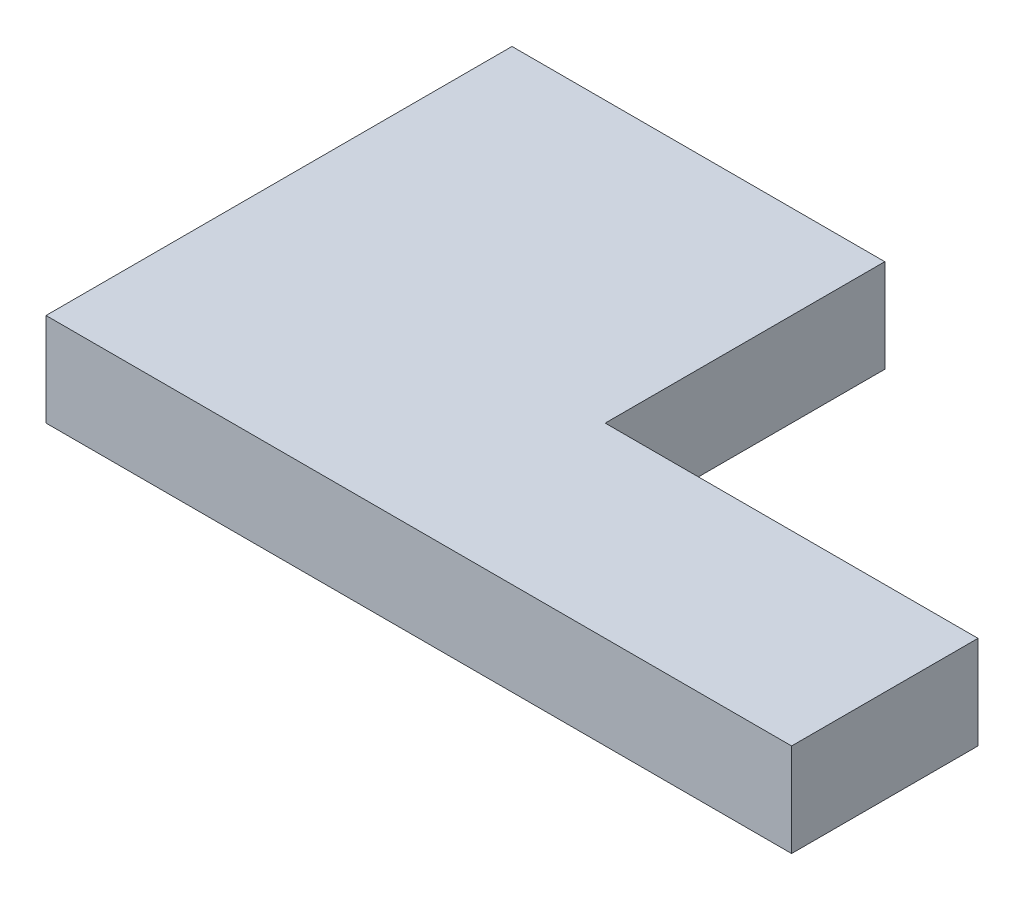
ISO-10303-21;
HEADER;
FILE_DESCRIPTION(('STEP AP214'),'2;1');
FILE_NAME('part.step','',(''),(''),'','','');
FILE_SCHEMA(('AUTOMOTIVE_DESIGN { 1 0 10303 214 1 1 1 1 }'));
ENDSEC;
DATA;
#1=APPLICATION_CONTEXT('core data for automotive mechanical design processes');
#2=APPLICATION_PROTOCOL_DEFINITION('international standard','automotive_design',2000,#1);
#3=PRODUCT_CONTEXT('',#1,'mechanical');
#4=PRODUCT('Part','Part','',(#3));
#5=PRODUCT_RELATED_PRODUCT_CATEGORY('part','',(#4));
#6=PRODUCT_DEFINITION_FORMATION('','',#4);
#7=PRODUCT_DEFINITION_CONTEXT('part definition',#1,'design');
#8=PRODUCT_DEFINITION('design','',#6,#7);
#9=PRODUCT_DEFINITION_SHAPE('','',#8);
#10=(LENGTH_UNIT() NAMED_UNIT(*) SI_UNIT(.MILLI.,.METRE.));
#11=(NAMED_UNIT(*) PLANE_ANGLE_UNIT() SI_UNIT($,.RADIAN.));
#12=(NAMED_UNIT(*) SI_UNIT($,.STERADIAN.) SOLID_ANGLE_UNIT());
#13=UNCERTAINTY_MEASURE_WITH_UNIT(LENGTH_MEASURE(1.E-05),#10,'distance_accuracy_value','');
#14=(GEOMETRIC_REPRESENTATION_CONTEXT(3) GLOBAL_UNCERTAINTY_ASSIGNED_CONTEXT((#13)) GLOBAL_UNIT_ASSIGNED_CONTEXT((#10,
#11,#12)) REPRESENTATION_CONTEXT('',''));
#15=CARTESIAN_POINT('',(0.,0.,0.));
#16=DIRECTION('',(0.,0.,1.));
#17=DIRECTION('',(1.,0.,0.));
#18=AXIS2_PLACEMENT_3D('',#15,#16,#17);
#19=CARTESIAN_POINT('',(100.,25.,-125.));
#20=DIRECTION('',(1.,0.,0.));
#21=DIRECTION('',(0.,0.,-1.));
#22=AXIS2_PLACEMENT_3D('',#19,#20,#21);
#23=PLANE('',#22);
#24=DIRECTION('',(0.,0.,1.));
#25=VECTOR('',#24,1.);
#26=CARTESIAN_POINT('',(100.,0.,-125.));
#27=LINE('',#26,#25);
#28=CARTESIAN_POINT('',(100.,0.,-125.));
#29=VERTEX_POINT('',#28);
#30=CARTESIAN_POINT('',(100.,0.,-50.));
#31=VERTEX_POINT('',#30);
#32=EDGE_CURVE('E117',#29,#31,#27,.T.);
#33=ORIENTED_EDGE('',*,*,#32,.F.);
#34=DIRECTION('',(0.,-1.,0.));
#35=VECTOR('',#34,1.);
#36=CARTESIAN_POINT('',(100.,25.,-125.));
#37=LINE('',#36,#35);
#38=CARTESIAN_POINT('',(100.,25.,-125.));
#39=VERTEX_POINT('',#38);
#40=EDGE_CURVE('E11',#39,#29,#37,.T.);
#41=ORIENTED_EDGE('',*,*,#40,.F.);
#42=DIRECTION('',(0.,0.,1.));
#43=VECTOR('',#42,1.);
#44=CARTESIAN_POINT('',(100.,25.,-125.));
#45=LINE('',#44,#43);
#46=CARTESIAN_POINT('',(100.,25.,-50.));
#47=VERTEX_POINT('',#46);
#48=EDGE_CURVE('E131',#39,#47,#45,.T.);
#49=ORIENTED_EDGE('',*,*,#48,.T.);
#50=DIRECTION('',(0.,-1.,0.));
#51=VECTOR('',#50,1.);
#52=CARTESIAN_POINT('',(100.,25.,-50.));
#53=LINE('',#52,#51);
#54=EDGE_CURVE('E35',#47,#31,#53,.T.);
#55=ORIENTED_EDGE('',*,*,#54,.T.);
#56=EDGE_LOOP('',(#33,#41,#49,#55));
#57=FACE_BOUND('',#56,.T.);
#58=ADVANCED_FACE('F32',(#57),#23,.T.);
#59=CARTESIAN_POINT('',(0.,25.,-125.));
#60=DIRECTION('',(0.,0.,-1.));
#61=DIRECTION('',(-1.,0.,0.));
#62=AXIS2_PLACEMENT_3D('',#59,#60,#61);
#63=PLANE('',#62);
#64=DIRECTION('',(1.,0.,0.));
#65=VECTOR('',#64,1.);
#66=CARTESIAN_POINT('',(0.,0.,-125.));
#67=LINE('',#66,#65);
#68=CARTESIAN_POINT('',(0.,0.,-125.));
#69=VERTEX_POINT('',#68);
#70=EDGE_CURVE('E129',#69,#29,#67,.T.);
#71=ORIENTED_EDGE('',*,*,#70,.F.);
#72=DIRECTION('',(0.,-1.,0.));
#73=VECTOR('',#72,1.);
#74=CARTESIAN_POINT('',(0.,25.,-125.));
#75=LINE('',#74,#73);
#76=CARTESIAN_POINT('',(0.,25.,-125.));
#77=VERTEX_POINT('',#76);
#78=EDGE_CURVE('E41',#77,#69,#75,.T.);
#79=ORIENTED_EDGE('',*,*,#78,.F.);
#80=DIRECTION('',(1.,0.,0.));
#81=VECTOR('',#80,1.);
#82=CARTESIAN_POINT('',(0.,25.,-125.));
#83=LINE('',#82,#81);
#84=EDGE_CURVE('E107',#77,#39,#83,.T.);
#85=ORIENTED_EDGE('',*,*,#84,.T.);
#86=ORIENTED_EDGE('',*,*,#40,.T.);
#87=EDGE_LOOP('',(#71,#79,#85,#86));
#88=FACE_BOUND('',#87,.T.);
#89=ADVANCED_FACE('F139',(#88),#63,.T.);
#90=CARTESIAN_POINT('',(0.,25.,0.));
#91=DIRECTION('',(-1.,0.,0.));
#92=DIRECTION('',(0.,0.,1.));
#93=AXIS2_PLACEMENT_3D('',#90,#91,#92);
#94=PLANE('',#93);
#95=DIRECTION('',(0.,0.,-1.));
#96=VECTOR('',#95,1.);
#97=CARTESIAN_POINT('',(0.,0.,0.));
#98=LINE('',#97,#96);
#99=CARTESIAN_POINT('',(0.,0.,0.));
#100=VERTEX_POINT('',#99);
#101=EDGE_CURVE('E94',#100,#69,#98,.T.);
#102=ORIENTED_EDGE('',*,*,#101,.F.);
#103=DIRECTION('',(0.,-1.,0.));
#104=VECTOR('',#103,1.);
#105=CARTESIAN_POINT('',(0.,25.,0.));
#106=LINE('',#105,#104);
#107=CARTESIAN_POINT('',(0.,25.,0.));
#108=VERTEX_POINT('',#107);
#109=EDGE_CURVE('E89',#108,#100,#106,.T.);
#110=ORIENTED_EDGE('',*,*,#109,.F.);
#111=DIRECTION('',(0.,0.,-1.));
#112=VECTOR('',#111,1.);
#113=CARTESIAN_POINT('',(0.,25.,0.));
#114=LINE('',#113,#112);
#115=EDGE_CURVE('E92',#108,#77,#114,.T.);
#116=ORIENTED_EDGE('',*,*,#115,.T.);
#117=ORIENTED_EDGE('',*,*,#78,.T.);
#118=EDGE_LOOP('',(#102,#110,#116,#117));
#119=FACE_BOUND('',#118,.T.);
#120=ADVANCED_FACE('F91',(#119),#94,.T.);
#121=CARTESIAN_POINT('',(0.,25.,0.));
#122=DIRECTION('',(0.,0.,1.));
#123=DIRECTION('',(1.,0.,0.));
#124=AXIS2_PLACEMENT_3D('',#121,#122,#123);
#125=PLANE('',#124);
#126=DIRECTION('',(-1.,0.,0.));
#127=VECTOR('',#126,1.);
#128=CARTESIAN_POINT('',(0.,0.,0.));
#129=LINE('',#128,#127);
#130=CARTESIAN_POINT('',(200.,0.,0.));
#131=VERTEX_POINT('',#130);
#132=EDGE_CURVE('E126',#131,#100,#129,.T.);
#133=ORIENTED_EDGE('',*,*,#132,.F.);
#134=DIRECTION('',(0.,-1.,0.));
#135=VECTOR('',#134,1.);
#136=CARTESIAN_POINT('',(200.,25.,0.));
#137=LINE('',#136,#135);
#138=CARTESIAN_POINT('',(200.,25.,0.));
#139=VERTEX_POINT('',#138);
#140=EDGE_CURVE('E99',#139,#131,#137,.T.);
#141=ORIENTED_EDGE('',*,*,#140,.F.);
#142=DIRECTION('',(-1.,0.,0.));
#143=VECTOR('',#142,1.);
#144=CARTESIAN_POINT('',(0.,25.,0.));
#145=LINE('',#144,#143);
#146=EDGE_CURVE('E105',#139,#108,#145,.T.);
#147=ORIENTED_EDGE('',*,*,#146,.T.);
#148=ORIENTED_EDGE('',*,*,#109,.T.);
#149=EDGE_LOOP('',(#133,#141,#147,#148));
#150=FACE_BOUND('',#149,.T.);
#151=ADVANCED_FACE('F109',(#150),#125,.T.);
#152=CARTESIAN_POINT('',(200.,25.,-50.));
#153=DIRECTION('',(1.,0.,0.));
#154=DIRECTION('',(0.,0.,-1.));
#155=AXIS2_PLACEMENT_3D('',#152,#153,#154);
#156=PLANE('',#155);
#157=DIRECTION('',(0.,0.,1.));
#158=VECTOR('',#157,1.);
#159=CARTESIAN_POINT('',(200.,0.,-50.));
#160=LINE('',#159,#158);
#161=CARTESIAN_POINT('',(200.,0.,-50.));
#162=VERTEX_POINT('',#161);
#163=EDGE_CURVE('E123',#162,#131,#160,.T.);
#164=ORIENTED_EDGE('',*,*,#163,.F.);
#165=DIRECTION('',(0.,-1.,0.));
#166=VECTOR('',#165,1.);
#167=CARTESIAN_POINT('',(200.,25.,-50.));
#168=LINE('',#167,#166);
#169=CARTESIAN_POINT('',(200.,25.,-50.));
#170=VERTEX_POINT('',#169);
#171=EDGE_CURVE('E134',#170,#162,#168,.T.);
#172=ORIENTED_EDGE('',*,*,#171,.F.);
#173=DIRECTION('',(0.,0.,1.));
#174=VECTOR('',#173,1.);
#175=CARTESIAN_POINT('',(200.,25.,-50.));
#176=LINE('',#175,#174);
#177=EDGE_CURVE('E110',#170,#139,#176,.T.);
#178=ORIENTED_EDGE('',*,*,#177,.T.);
#179=ORIENTED_EDGE('',*,*,#140,.T.);
#180=EDGE_LOOP('',(#164,#172,#178,#179));
#181=FACE_BOUND('',#180,.T.);
#182=ADVANCED_FACE('F152',(#181),#156,.T.);
#183=CARTESIAN_POINT('',(200.,25.,-50.));
#184=DIRECTION('',(0.,0.,-1.));
#185=DIRECTION('',(-1.,0.,0.));
#186=AXIS2_PLACEMENT_3D('',#183,#184,#185);
#187=PLANE('',#186);
#188=DIRECTION('',(1.,0.,0.));
#189=VECTOR('',#188,1.);
#190=CARTESIAN_POINT('',(200.,0.,-50.));
#191=LINE('',#190,#189);
#192=EDGE_CURVE('E120',#31,#162,#191,.T.);
#193=ORIENTED_EDGE('',*,*,#192,.F.);
#194=ORIENTED_EDGE('',*,*,#54,.F.);
#195=DIRECTION('',(1.,0.,0.));
#196=VECTOR('',#195,1.);
#197=CARTESIAN_POINT('',(200.,25.,-50.));
#198=LINE('',#197,#196);
#199=EDGE_CURVE('E112',#47,#170,#198,.T.);
#200=ORIENTED_EDGE('',*,*,#199,.T.);
#201=ORIENTED_EDGE('',*,*,#171,.T.);
#202=EDGE_LOOP('',(#193,#194,#200,#201));
#203=FACE_BOUND('',#202,.T.);
#204=ADVANCED_FACE('F136',(#203),#187,.T.);
#205=CARTESIAN_POINT('',(0.,25.,0.));
#206=DIRECTION('',(0.,-1.,0.));
#207=DIRECTION('',(0.,0.,-1.));
#208=AXIS2_PLACEMENT_3D('',#205,#206,#207);
#209=PLANE('',#208);
#210=ORIENTED_EDGE('',*,*,#48,.F.);
#211=ORIENTED_EDGE('',*,*,#84,.F.);
#212=ORIENTED_EDGE('',*,*,#115,.F.);
#213=ORIENTED_EDGE('',*,*,#146,.F.);
#214=ORIENTED_EDGE('',*,*,#177,.F.);
#215=ORIENTED_EDGE('',*,*,#199,.F.);
#216=EDGE_LOOP('',(#210,#211,#212,#213,#214,#215));
#217=FACE_BOUND('',#216,.T.);
#218=ADVANCED_FACE('F103',(#217),#209,.F.);
#219=CARTESIAN_POINT('',(0.,0.,0.));
#220=DIRECTION('',(0.,-1.,0.));
#221=DIRECTION('',(0.,0.,-1.));
#222=AXIS2_PLACEMENT_3D('',#219,#220,#221);
#223=PLANE('',#222);
#224=ORIENTED_EDGE('',*,*,#32,.T.);
#225=ORIENTED_EDGE('',*,*,#192,.T.);
#226=ORIENTED_EDGE('',*,*,#163,.T.);
#227=ORIENTED_EDGE('',*,*,#132,.T.);
#228=ORIENTED_EDGE('',*,*,#101,.T.);
#229=ORIENTED_EDGE('',*,*,#70,.T.);
#230=EDGE_LOOP('',(#224,#225,#226,#227,#228,#229));
#231=FACE_BOUND('',#230,.T.);
#232=ADVANCED_FACE('F138',(#231),#223,.T.);
#233=CLOSED_SHELL('',(#58,#89,#120,#151,#182,#204,#218,#232));
#234=MANIFOLD_SOLID_BREP('B2',#233);
#235=ADVANCED_BREP_SHAPE_REPRESENTATION('',(#18,#234),#14);
#236=SHAPE_DEFINITION_REPRESENTATION(#9,#235);
ENDSEC;
END-ISO-10303-21;
